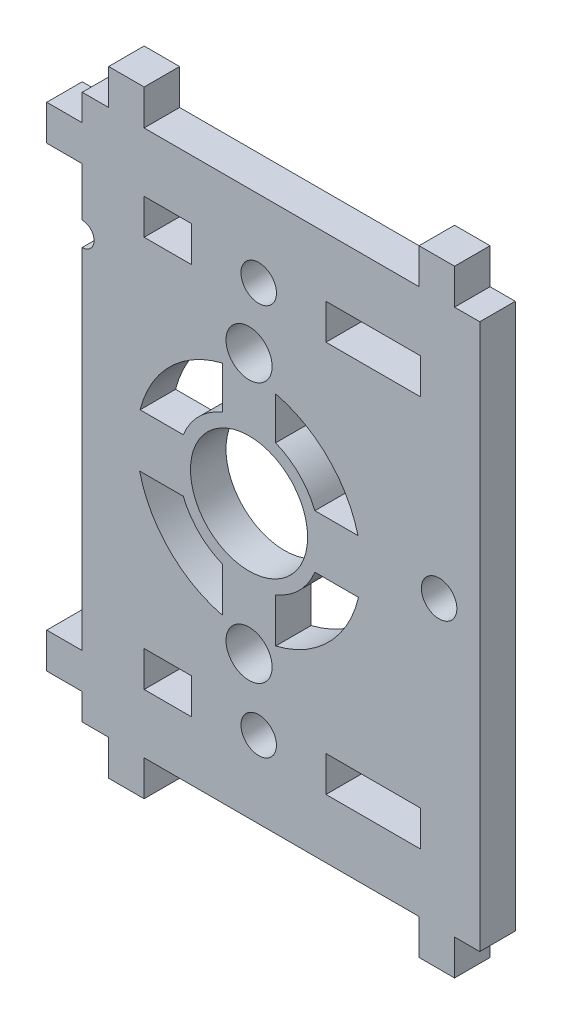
from build123d import *

# Parameters (mm, degrees)
SKETCH1_R           = 1.95
SKETCH1_R_2         = 4.95
SKETCH1_R_3         = 1.5
SKETCH1_W           = 4
SKETCH1_H           = 3
SKETCH1_W_2         = 8
BOSS_EXTRUDE1_DEPTH = 3


with BuildPart() as part:
    # Sketch1 → Boss-Extrude1 (new body)
    with BuildSketch(Plane.XY):
        with BuildLine():
            Line((10.452483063, 212.041147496), (13.452483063, 212.041147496))
            Line((13.452483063, 212.041147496), (13.452483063, 209.041147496))
            Line((13.452483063, 209.041147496), (36.688713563, 209.041147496))
            Line((36.688713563, 209.041147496), (36.688713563, 212.041147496))
            Line((36.688713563, 212.041147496), (39.688713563, 212.041147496))
            Line((39.688713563, 212.041147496), (39.688713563, 209.041147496))
            Line((39.688713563, 209.041147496), (41.820598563, 209.041147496))
            Line((41.820598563, 209.041147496), (41.820598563, 162.941147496))
            Line((41.820598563, 162.941147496), (39.688713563, 162.941147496))
            Line((39.688713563, 162.941147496), (39.688713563, 159.941147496))
            Line((39.688713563, 159.941147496), (36.688713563, 159.941147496))
            Line((36.688713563, 159.941147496), (36.688713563, 162.941147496))
            Line((36.688713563, 162.941147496), (13.452483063, 162.941147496))
            Line((13.452483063, 162.941147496), (13.452483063, 159.941147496))
            Line((13.452483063, 159.941147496), (10.452483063, 159.941147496))
            Line((10.452483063, 159.941147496), (10.452483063, 162.941147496))
            Line((10.452483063, 162.941147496), (8.220599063, 162.941147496))
            Line((8.220599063, 162.941147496), (8.220599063, 165.173047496))
            Line((8.220599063, 165.173047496), (5.220599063, 165.173047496))
            Line((5.220599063, 165.173047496), (5.220599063, 168.173047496))
            Line((5.220599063, 168.173047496), (8.220599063, 168.173047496))
            Line((8.220599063, 168.173047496), (8.220599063, 197.67702847))
            ThreePointArc((8.220599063, 197.67702847), (9.220599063, 198.67702847), (8.220599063, 199.67702847))
            Line((8.220599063, 199.67702847), (8.220599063, 203.809247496))
            Line((8.220599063, 203.809247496), (5.220599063, 203.809247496))
            Line((5.220599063, 203.809247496), (5.220599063, 206.809247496))
            Line((5.220599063, 206.809247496), (8.220599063, 206.809247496))
            Line((8.220599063, 206.809247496), (8.220599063, 209.041147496))
            Line((8.220599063, 209.041147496), (10.452483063, 209.041147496))
            Line((10.452483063, 209.041147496), (10.452483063, 212.041147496))
        make_face()
        with Locations((22.320563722, 174.991147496)):
            Circle(SKETCH1_R, mode=Mode.SUBTRACT)
        with Locations((22.320563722, 196.991147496)):
            Circle(SKETCH1_R, mode=Mode.SUBTRACT)
        with Locations((22.320563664, 185.991147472)):
            Circle(SKETCH1_R_2, mode=Mode.SUBTRACT)
        with Locations((23.136540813, 202.541147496)):
            Circle(SKETCH1_R_3, mode=Mode.SUBTRACT)
        with Locations((23.136540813, 169.441147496)):
            Circle(SKETCH1_R_3, mode=Mode.SUBTRACT)
        with Locations((38.384299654, 187.07114189)):
            Circle(SKETCH1_R_3, mode=Mode.SUBTRACT)
        with BuildLine():
            Line((24.570563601, 195.140420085), (24.570563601, 191.553296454))
            ThreePointArc((24.570563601, 191.553296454), (26.563204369, 190.233788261), (27.882712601, 188.241147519))
            Line((27.882712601, 188.241147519), (31.530290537, 188.241147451))
            ThreePointArc((31.530290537, 188.241147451), (29.008711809, 192.657465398), (24.570563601, 195.140420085))
        make_face(mode=Mode.SUBTRACT)
        with BuildLine():
            Line((24.570563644, 180.428998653), (24.570563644, 176.681005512))
            ThreePointArc((24.570563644, 176.681005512), (29.067254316, 179.222501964), (31.569508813, 183.741147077))
            Line((31.569508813, 183.741147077), (27.882712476, 183.741147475))
            ThreePointArc((27.882712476, 183.741147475), (26.563204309, 181.748506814), (24.570563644, 180.428998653))
        make_face(mode=Mode.SUBTRACT)
        with BuildLine():
            Line((20.070563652, 195.14042048), (20.070563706, 191.55329637))
            ThreePointArc((20.070563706, 191.55329637), (18.077922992, 190.233788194), (16.758414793, 188.241147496))
            Line((16.758414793, 188.241147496), (13.110836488, 188.241147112))
            ThreePointArc((13.110836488, 188.241147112), (15.632415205, 192.657465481), (20.070563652, 195.14042048))
        make_face(mode=Mode.SUBTRACT)
        with BuildLine():
            Line((20.070563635, 180.428998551), (20.070563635, 176.68100541))
            ThreePointArc((20.070563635, 176.68100541), (15.573873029, 179.222501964), (13.071618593, 183.741147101))
            Line((13.071618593, 183.741147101), (16.758414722, 183.741147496))
            ThreePointArc((16.758414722, 183.741147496), (18.077922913, 181.748506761), (20.070563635, 180.428998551))
        make_face(mode=Mode.SUBTRACT)
        with Locations((15.452483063, 202.541147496)):
            Rectangle(SKETCH1_W, SKETCH1_H, mode=Mode.SUBTRACT)
        with Locations((32.820598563, 202.541147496)):
            Rectangle(SKETCH1_W_2, SKETCH1_H, mode=Mode.SUBTRACT)
        with Locations((15.452483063, 169.441147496)):
            Rectangle(SKETCH1_W, SKETCH1_H, mode=Mode.SUBTRACT)
        with Locations((32.820598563, 169.441147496)):
            Rectangle(SKETCH1_W_2, SKETCH1_H, mode=Mode.SUBTRACT)
    extrude(amount=BOSS_EXTRUDE1_DEPTH)


solid = part.part
